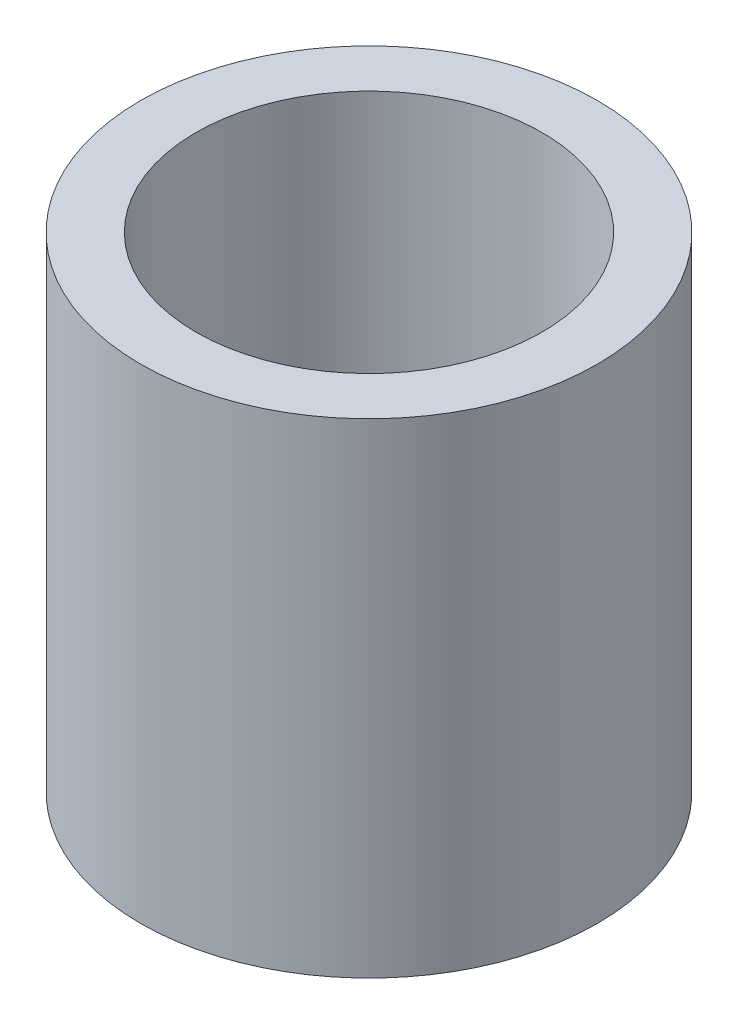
from build123d import *

# Parameters (mm, degrees)
SKETCH1_R          = 33
SKETCH1_R_2        = 25
BASE_EXTRUDE_DEPTH = 70


with BuildPart() as part:
    # Sketch1 → Base-Extrude (new body)
    with BuildSketch(Plane(origin=(0, 0, 0), x_dir=(1, 0, 0), z_dir=(0, 1, 0))):
        with Locations(Location((0, 0, 0), (0, 0, 270))):
            Circle(SKETCH1_R)
        with Locations(Location((0, 0, 0), (0, 0, 270))):
            Circle(SKETCH1_R_2, mode=Mode.SUBTRACT)
    extrude(amount=BASE_EXTRUDE_DEPTH)


solid = part.part
